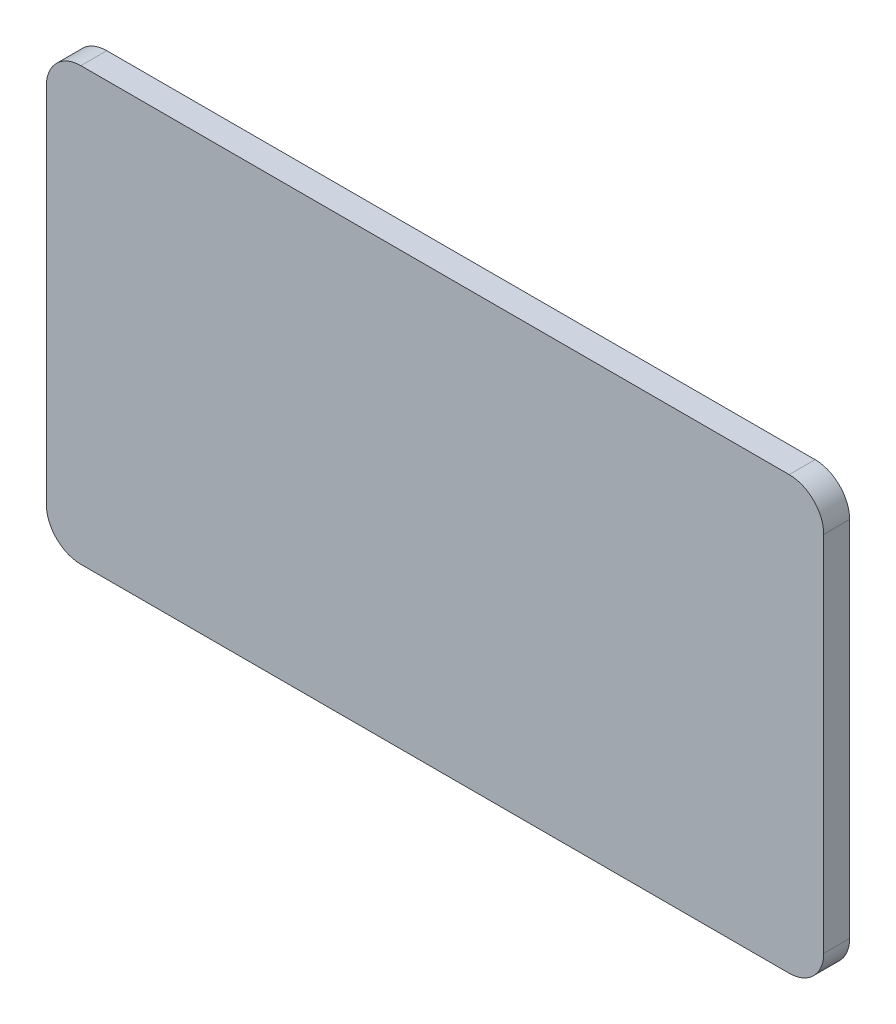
from build123d import *

# Parameters (mm, degrees)
EXTRUDE1_DEPTH = 3.81


with BuildPart() as part:
    # Sketch1 → Extrude1 (new body)
    with BuildSketch(Plane.XY):
        with BuildLine():
            Line((-120.65, -11.43), (-120.65, -64.77))
            ThreePointArc((-120.65, -64.77), (-119.162102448, -68.362102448), (-115.57, -69.85))
            Line((-115.57, -69.85), (-11.43, -69.85))
            ThreePointArc((-11.43, -69.85), (-7.837897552, -68.362102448), (-6.35, -64.77))
            Line((-6.35, -64.77), (-6.35, -11.43))
            ThreePointArc((-6.35, -11.43), (-7.837897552, -7.837897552), (-11.43, -6.35))
            Line((-11.43, -6.35), (-115.57, -6.35))
            ThreePointArc((-115.57, -6.35), (-119.162102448, -7.837897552), (-120.65, -11.43))
        make_face()
    extrude(amount=EXTRUDE1_DEPTH)


solid = part.part
